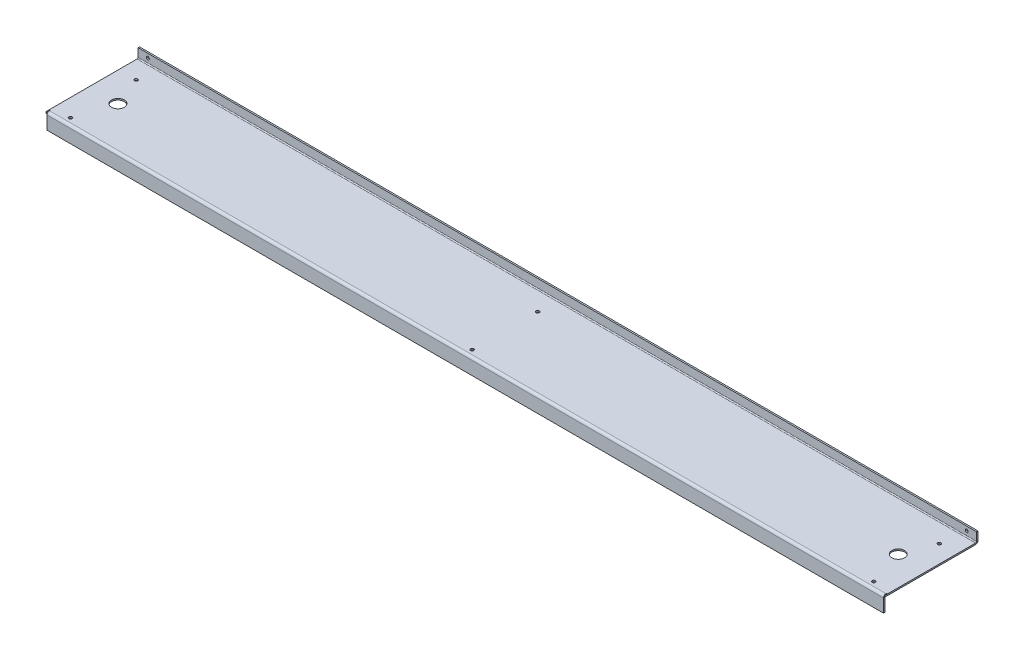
ISO-10303-21;
HEADER;
FILE_DESCRIPTION(('STEP AP214'),'2;1');
FILE_NAME('part.step','',(''),(''),'','','');
FILE_SCHEMA(('AUTOMOTIVE_DESIGN { 1 0 10303 214 1 1 1 1 }'));
ENDSEC;
DATA;
#1=APPLICATION_CONTEXT('core data for automotive mechanical design processes');
#2=APPLICATION_PROTOCOL_DEFINITION('international standard','automotive_design',2000,#1);
#3=PRODUCT_CONTEXT('',#1,'mechanical');
#4=PRODUCT('Part','Part','',(#3));
#5=PRODUCT_RELATED_PRODUCT_CATEGORY('part','',(#4));
#6=PRODUCT_DEFINITION_FORMATION('','',#4);
#7=PRODUCT_DEFINITION_CONTEXT('part definition',#1,'design');
#8=PRODUCT_DEFINITION('design','',#6,#7);
#9=PRODUCT_DEFINITION_SHAPE('','',#8);
#10=(LENGTH_UNIT() NAMED_UNIT(*) SI_UNIT(.MILLI.,.METRE.));
#11=(NAMED_UNIT(*) PLANE_ANGLE_UNIT() SI_UNIT($,.RADIAN.));
#12=(NAMED_UNIT(*) SI_UNIT($,.STERADIAN.) SOLID_ANGLE_UNIT());
#13=UNCERTAINTY_MEASURE_WITH_UNIT(LENGTH_MEASURE(1.E-05),#10,'distance_accuracy_value','');
#14=(GEOMETRIC_REPRESENTATION_CONTEXT(3) GLOBAL_UNCERTAINTY_ASSIGNED_CONTEXT((#13)) GLOBAL_UNIT_ASSIGNED_CONTEXT((#10,
#11,#12)) REPRESENTATION_CONTEXT('',''));
#15=CARTESIAN_POINT('',(0.,0.,0.));
#16=DIRECTION('',(0.,0.,1.));
#17=DIRECTION('',(1.,0.,0.));
#18=AXIS2_PLACEMENT_3D('',#15,#16,#17);
#19=CARTESIAN_POINT('',(0.,272.7,9.61011135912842E-13));
#20=DIRECTION('',(0.,1.,0.));
#21=DIRECTION('',(0.,0.,1.));
#22=AXIS2_PLACEMENT_3D('',#19,#20,#21);
#23=PLANE('',#22);
#24=CARTESIAN_POINT('',(398.399999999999,272.7,51.7500000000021));
#25=DIRECTION('',(0.,-1.,0.));
#26=DIRECTION('',(0.,0.,-1.));
#27=AXIS2_PLACEMENT_3D('',#24,#25,#26);
#28=CIRCLE('',#27,6.50000000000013);
#29=CARTESIAN_POINT('',(398.399999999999,272.7,45.250000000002));
#30=VERTEX_POINT('',#29);
#31=EDGE_CURVE('E480',#30,#30,#28,.T.);
#32=ORIENTED_EDGE('',*,*,#31,.F.);
#33=EDGE_LOOP('',(#32));
#34=FACE_BOUND('',#33,.T.);
#35=CARTESIAN_POINT('',(-398.4,272.7,51.7500000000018));
#36=DIRECTION('',(0.,-1.,0.));
#37=DIRECTION('',(0.,0.,-1.));
#38=AXIS2_PLACEMENT_3D('',#35,#36,#37);
#39=CIRCLE('',#38,6.50000000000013);
#40=CARTESIAN_POINT('',(-398.4,272.7,45.2500000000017));
#41=VERTEX_POINT('',#40);
#42=EDGE_CURVE('E474',#41,#41,#39,.T.);
#43=ORIENTED_EDGE('',*,*,#42,.F.);
#44=EDGE_LOOP('',(#43));
#45=FACE_BOUND('',#44,.T.);
#46=CARTESIAN_POINT('',(-410.099999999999,272.7,88.5000000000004));
#47=DIRECTION('',(0.,-1.,0.));
#48=DIRECTION('',(0.,0.,-1.));
#49=AXIS2_PLACEMENT_3D('',#46,#47,#48);
#50=CIRCLE('',#49,1.65000000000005);
#51=CARTESIAN_POINT('',(-410.099999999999,272.7,86.8500000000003));
#52=VERTEX_POINT('',#51);
#53=EDGE_CURVE('E456',#52,#52,#50,.T.);
#54=ORIENTED_EDGE('',*,*,#53,.F.);
#55=EDGE_LOOP('',(#54));
#56=FACE_BOUND('',#55,.T.);
#57=CARTESIAN_POINT('',(-1.65867280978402E-13,272.7,21.5000000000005));
#58=DIRECTION('',(0.,-1.,0.));
#59=DIRECTION('',(0.,0.,-1.));
#60=AXIS2_PLACEMENT_3D('',#57,#58,#59);
#61=CIRCLE('',#60,1.65);
#62=CARTESIAN_POINT('',(-1.65867280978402E-13,272.7,19.8500000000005));
#63=VERTEX_POINT('',#62);
#64=EDGE_CURVE('E463',#63,#63,#61,.T.);
#65=ORIENTED_EDGE('',*,*,#64,.F.);
#66=EDGE_LOOP('',(#65));
#67=FACE_BOUND('',#66,.T.);
#68=CARTESIAN_POINT('',(4.44755382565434E-13,272.7,88.5000000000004));
#69=DIRECTION('',(0.,-1.,0.));
#70=DIRECTION('',(0.,0.,-1.));
#71=AXIS2_PLACEMENT_3D('',#68,#69,#70);
#72=CIRCLE('',#71,1.65);
#73=CARTESIAN_POINT('',(4.44755382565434E-13,272.7,86.8500000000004));
#74=VERTEX_POINT('',#73);
#75=EDGE_CURVE('E444',#74,#74,#72,.T.);
#76=ORIENTED_EDGE('',*,*,#75,.F.);
#77=EDGE_LOOP('',(#76));
#78=FACE_BOUND('',#77,.T.);
#79=CARTESIAN_POINT('',(410.1,272.7,21.5000000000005));
#80=DIRECTION('',(0.,-1.,0.));
#81=DIRECTION('',(0.,0.,-1.));
#82=AXIS2_PLACEMENT_3D('',#79,#80,#81);
#83=CIRCLE('',#82,1.65000000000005);
#84=CARTESIAN_POINT('',(410.1,272.7,19.8500000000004));
#85=VERTEX_POINT('',#84);
#86=EDGE_CURVE('E451',#85,#85,#83,.T.);
#87=ORIENTED_EDGE('',*,*,#86,.F.);
#88=EDGE_LOOP('',(#87));
#89=FACE_BOUND('',#88,.T.);
#90=CARTESIAN_POINT('',(-410.1,272.7,21.5000000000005));
#91=DIRECTION('',(0.,-1.,0.));
#92=DIRECTION('',(0.,0.,-1.));
#93=AXIS2_PLACEMENT_3D('',#90,#91,#92);
#94=CIRCLE('',#93,1.65000000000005);
#95=CARTESIAN_POINT('',(-410.1,272.7,19.8500000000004));
#96=VERTEX_POINT('',#95);
#97=EDGE_CURVE('E468',#96,#96,#94,.T.);
#98=ORIENTED_EDGE('',*,*,#97,.F.);
#99=EDGE_LOOP('',(#98));
#100=FACE_BOUND('',#99,.T.);
#101=CARTESIAN_POINT('',(410.1,272.7,88.5000000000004));
#102=DIRECTION('',(0.,-1.,0.));
#103=DIRECTION('',(0.,0.,-1.));
#104=AXIS2_PLACEMENT_3D('',#101,#102,#103);
#105=CIRCLE('',#104,1.65000000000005);
#106=CARTESIAN_POINT('',(410.1,272.7,86.8500000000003));
#107=VERTEX_POINT('',#106);
#108=EDGE_CURVE('E438',#107,#107,#105,.T.);
#109=ORIENTED_EDGE('',*,*,#108,.F.);
#110=EDGE_LOOP('',(#109));
#111=FACE_BOUND('',#110,.T.);
#112=DIRECTION('',(0.,0.,-1.));
#113=VECTOR('',#112,1.);
#114=CARTESIAN_POINT('',(-427.85,272.7,95.5));
#115=LINE('',#114,#113);
#116=CARTESIAN_POINT('',(-427.85,272.7,95.5));
#117=VERTEX_POINT('',#116);
#118=CARTESIAN_POINT('',(-427.85,272.7,92.25));
#119=VERTEX_POINT('',#118);
#120=EDGE_CURVE('E284',#117,#119,#115,.T.);
#121=ORIENTED_EDGE('',*,*,#120,.F.);
#122=DIRECTION('',(-1.,0.,0.));
#123=VECTOR('',#122,1.);
#124=CARTESIAN_POINT('',(0.,272.7,95.5));
#125=LINE('',#124,#123);
#126=CARTESIAN_POINT('',(-428.1,272.7,95.5));
#127=VERTEX_POINT('',#126);
#128=EDGE_CURVE('E333',#117,#127,#125,.T.);
#129=ORIENTED_EDGE('',*,*,#128,.T.);
#130=DIRECTION('',(0.,0.,-1.));
#131=VECTOR('',#130,1.);
#132=CARTESIAN_POINT('',(-428.1,272.7,4.55387224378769E-13));
#133=LINE('',#132,#131);
#134=CARTESIAN_POINT('',(-428.1,272.7,2.5));
#135=VERTEX_POINT('',#134);
#136=EDGE_CURVE('E327',#127,#135,#133,.T.);
#137=ORIENTED_EDGE('',*,*,#136,.T.);
#138=DIRECTION('',(1.,0.,0.));
#139=VECTOR('',#138,1.);
#140=CARTESIAN_POINT('',(-428.1,272.7,2.5));
#141=LINE('',#140,#139);
#142=CARTESIAN_POINT('',(428.1,272.7,2.5));
#143=VERTEX_POINT('',#142);
#144=EDGE_CURVE('E344',#143,#135,#141,.F.);
#145=ORIENTED_EDGE('',*,*,#144,.F.);
#146=DIRECTION('',(0.,0.,1.));
#147=VECTOR('',#146,1.);
#148=CARTESIAN_POINT('',(428.1,272.7,9.61011135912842E-13));
#149=LINE('',#148,#147);
#150=CARTESIAN_POINT('',(428.1,272.7,95.5));
#151=VERTEX_POINT('',#150);
#152=EDGE_CURVE('E334',#143,#151,#149,.T.);
#153=ORIENTED_EDGE('',*,*,#152,.T.);
#154=CARTESIAN_POINT('',(427.85,272.7,95.5));
#155=VERTEX_POINT('',#154);
#156=EDGE_CURVE('E330',#151,#155,#125,.T.);
#157=ORIENTED_EDGE('',*,*,#156,.T.);
#158=DIRECTION('',(0.,0.,1.));
#159=VECTOR('',#158,1.);
#160=CARTESIAN_POINT('',(427.85,272.7,92.25));
#161=LINE('',#160,#159);
#162=CARTESIAN_POINT('',(427.85,272.7,92.25));
#163=VERTEX_POINT('',#162);
#164=EDGE_CURVE('E300',#163,#155,#161,.T.);
#165=ORIENTED_EDGE('',*,*,#164,.F.);
#166=DIRECTION('',(1.,0.,0.));
#167=VECTOR('',#166,1.);
#168=CARTESIAN_POINT('',(427.1,272.7,92.25));
#169=LINE('',#168,#167);
#170=CARTESIAN_POINT('',(427.1,272.7,92.25));
#171=VERTEX_POINT('',#170);
#172=EDGE_CURVE('E296',#171,#163,#169,.T.);
#173=ORIENTED_EDGE('',*,*,#172,.F.);
#174=DIRECTION('',(0.,0.,-1.));
#175=VECTOR('',#174,1.);
#176=CARTESIAN_POINT('',(427.1,272.7,93.));
#177=LINE('',#176,#175);
#178=CARTESIAN_POINT('',(427.1,272.7,93.));
#179=VERTEX_POINT('',#178);
#180=EDGE_CURVE('E293',#179,#171,#177,.T.);
#181=ORIENTED_EDGE('',*,*,#180,.F.);
#182=DIRECTION('',(-1.,0.,0.));
#183=VECTOR('',#182,1.);
#184=CARTESIAN_POINT('',(-427.1,272.7,93.));
#185=LINE('',#184,#183);
#186=CARTESIAN_POINT('',(-427.1,272.7,93.));
#187=VERTEX_POINT('',#186);
#188=EDGE_CURVE('E275',#187,#179,#185,.F.);
#189=ORIENTED_EDGE('',*,*,#188,.F.);
#190=DIRECTION('',(0.,0.,1.));
#191=VECTOR('',#190,1.);
#192=CARTESIAN_POINT('',(-427.1,272.7,92.25));
#193=LINE('',#192,#191);
#194=CARTESIAN_POINT('',(-427.1,272.7,92.25));
#195=VERTEX_POINT('',#194);
#196=EDGE_CURVE('E98',#195,#187,#193,.T.);
#197=ORIENTED_EDGE('',*,*,#196,.F.);
#198=DIRECTION('',(1.,0.,0.));
#199=VECTOR('',#198,1.);
#200=CARTESIAN_POINT('',(-427.85,272.7,92.25));
#201=LINE('',#200,#199);
#202=EDGE_CURVE('E93',#119,#195,#201,.T.);
#203=ORIENTED_EDGE('',*,*,#202,.F.);
#204=EDGE_LOOP('',(#121,#129,#137,#145,#153,#157,#165,#173,#181,#189,#197,#203));
#205=FACE_BOUND('',#204,.T.);
#206=ADVANCED_FACE('F78',(#34,#45,#56,#67,#78,#89,#100,#111,#205),#23,.F.);
#207=CARTESIAN_POINT('',(0.,274.2,9.66248357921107E-13));
#208=DIRECTION('',(0.,1.,0.));
#209=DIRECTION('',(0.,0.,1.));
#210=AXIS2_PLACEMENT_3D('',#207,#208,#209);
#211=PLANE('',#210);
#212=CARTESIAN_POINT('',(398.399999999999,274.2,51.7500000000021));
#213=DIRECTION('',(0.,-1.,0.));
#214=DIRECTION('',(0.,0.,-1.));
#215=AXIS2_PLACEMENT_3D('',#212,#213,#214);
#216=CIRCLE('',#215,6.50000000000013);
#217=CARTESIAN_POINT('',(398.399999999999,274.2,45.250000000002));
#218=VERTEX_POINT('',#217);
#219=EDGE_CURVE('E471',#218,#218,#216,.T.);
#220=ORIENTED_EDGE('',*,*,#219,.T.);
#221=EDGE_LOOP('',(#220));
#222=FACE_BOUND('',#221,.T.);
#223=CARTESIAN_POINT('',(-398.4,274.2,51.7500000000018));
#224=DIRECTION('',(0.,-1.,0.));
#225=DIRECTION('',(0.,0.,-1.));
#226=AXIS2_PLACEMENT_3D('',#223,#224,#225);
#227=CIRCLE('',#226,6.50000000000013);
#228=CARTESIAN_POINT('',(-398.4,274.2,45.2500000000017));
#229=VERTEX_POINT('',#228);
#230=EDGE_CURVE('E477',#229,#229,#227,.T.);
#231=ORIENTED_EDGE('',*,*,#230,.T.);
#232=EDGE_LOOP('',(#231));
#233=FACE_BOUND('',#232,.T.);
#234=CARTESIAN_POINT('',(-410.099999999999,274.2,88.5000000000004));
#235=DIRECTION('',(0.,-1.,0.));
#236=DIRECTION('',(0.,0.,-1.));
#237=AXIS2_PLACEMENT_3D('',#234,#235,#236);
#238=CIRCLE('',#237,1.65000000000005);
#239=CARTESIAN_POINT('',(-410.099999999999,274.2,86.8500000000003));
#240=VERTEX_POINT('',#239);
#241=EDGE_CURVE('E459',#240,#240,#238,.T.);
#242=ORIENTED_EDGE('',*,*,#241,.T.);
#243=EDGE_LOOP('',(#242));
#244=FACE_BOUND('',#243,.T.);
#245=CARTESIAN_POINT('',(-1.65867280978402E-13,274.2,21.5000000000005));
#246=DIRECTION('',(0.,-1.,0.));
#247=DIRECTION('',(0.,0.,-1.));
#248=AXIS2_PLACEMENT_3D('',#245,#246,#247);
#249=CIRCLE('',#248,1.65);
#250=CARTESIAN_POINT('',(-1.65867280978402E-13,274.2,19.8500000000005));
#251=VERTEX_POINT('',#250);
#252=EDGE_CURVE('E448',#251,#251,#249,.T.);
#253=ORIENTED_EDGE('',*,*,#252,.T.);
#254=EDGE_LOOP('',(#253));
#255=FACE_BOUND('',#254,.T.);
#256=CARTESIAN_POINT('',(4.44755382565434E-13,274.2,88.5000000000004));
#257=DIRECTION('',(0.,-1.,0.));
#258=DIRECTION('',(0.,0.,-1.));
#259=AXIS2_PLACEMENT_3D('',#256,#257,#258);
#260=CIRCLE('',#259,1.65);
#261=CARTESIAN_POINT('',(4.44755382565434E-13,274.2,86.8500000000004));
#262=VERTEX_POINT('',#261);
#263=EDGE_CURVE('E447',#262,#262,#260,.T.);
#264=ORIENTED_EDGE('',*,*,#263,.T.);
#265=EDGE_LOOP('',(#264));
#266=FACE_BOUND('',#265,.T.);
#267=CARTESIAN_POINT('',(410.1,274.2,21.5000000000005));
#268=DIRECTION('',(0.,-1.,0.));
#269=DIRECTION('',(0.,0.,-1.));
#270=AXIS2_PLACEMENT_3D('',#267,#268,#269);
#271=CIRCLE('',#270,1.65000000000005);
#272=CARTESIAN_POINT('',(410.1,274.2,19.8500000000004));
#273=VERTEX_POINT('',#272);
#274=EDGE_CURVE('E441',#273,#273,#271,.T.);
#275=ORIENTED_EDGE('',*,*,#274,.T.);
#276=EDGE_LOOP('',(#275));
#277=FACE_BOUND('',#276,.T.);
#278=CARTESIAN_POINT('',(-410.1,274.2,21.5000000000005));
#279=DIRECTION('',(0.,-1.,0.));
#280=DIRECTION('',(0.,0.,-1.));
#281=AXIS2_PLACEMENT_3D('',#278,#279,#280);
#282=CIRCLE('',#281,1.65000000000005);
#283=CARTESIAN_POINT('',(-410.1,274.2,19.8500000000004));
#284=VERTEX_POINT('',#283);
#285=EDGE_CURVE('E460',#284,#284,#282,.T.);
#286=ORIENTED_EDGE('',*,*,#285,.T.);
#287=EDGE_LOOP('',(#286));
#288=FACE_BOUND('',#287,.T.);
#289=CARTESIAN_POINT('',(410.1,274.2,88.5000000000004));
#290=DIRECTION('',(0.,-1.,0.));
#291=DIRECTION('',(0.,0.,-1.));
#292=AXIS2_PLACEMENT_3D('',#289,#290,#291);
#293=CIRCLE('',#292,1.65000000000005);
#294=CARTESIAN_POINT('',(410.1,274.2,86.8500000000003));
#295=VERTEX_POINT('',#294);
#296=EDGE_CURVE('E430',#295,#295,#293,.T.);
#297=ORIENTED_EDGE('',*,*,#296,.T.);
#298=EDGE_LOOP('',(#297));
#299=FACE_BOUND('',#298,.T.);
#300=DIRECTION('',(1.,0.,0.));
#301=VECTOR('',#300,1.);
#302=CARTESIAN_POINT('',(-428.1,274.2,95.5));
#303=LINE('',#302,#301);
#304=CARTESIAN_POINT('',(-427.85,274.2,95.5));
#305=VERTEX_POINT('',#304);
#306=CARTESIAN_POINT('',(-428.1,274.2,95.5));
#307=VERTEX_POINT('',#306);
#308=EDGE_CURVE('E341',#305,#307,#303,.F.);
#309=ORIENTED_EDGE('',*,*,#308,.F.);
#310=DIRECTION('',(0.,0.,-1.));
#311=VECTOR('',#310,1.);
#312=CARTESIAN_POINT('',(-427.85,274.2,9.66248357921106E-13));
#313=LINE('',#312,#311);
#314=CARTESIAN_POINT('',(-427.85,274.2,92.25));
#315=VERTEX_POINT('',#314);
#316=EDGE_CURVE('E317',#305,#315,#313,.T.);
#317=ORIENTED_EDGE('',*,*,#316,.T.);
#318=DIRECTION('',(1.,0.,0.));
#319=VECTOR('',#318,1.);
#320=CARTESIAN_POINT('',(0.,274.2,92.25));
#321=LINE('',#320,#319);
#322=CARTESIAN_POINT('',(-427.1,274.2,92.25));
#323=VERTEX_POINT('',#322);
#324=EDGE_CURVE('E13',#315,#323,#321,.T.);
#325=ORIENTED_EDGE('',*,*,#324,.T.);
#326=DIRECTION('',(0.,0.,1.));
#327=VECTOR('',#326,1.);
#328=CARTESIAN_POINT('',(-427.1,274.2,9.66248357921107E-13));
#329=LINE('',#328,#327);
#330=CARTESIAN_POINT('',(-427.1,274.2,93.));
#331=VERTEX_POINT('',#330);
#332=EDGE_CURVE('E86',#323,#331,#329,.T.);
#333=ORIENTED_EDGE('',*,*,#332,.T.);
#334=DIRECTION('',(-1.,0.,0.));
#335=VECTOR('',#334,1.);
#336=CARTESIAN_POINT('',(-427.1,274.2,93.));
#337=LINE('',#336,#335);
#338=CARTESIAN_POINT('',(427.1,274.2,93.));
#339=VERTEX_POINT('',#338);
#340=EDGE_CURVE('E220',#331,#339,#337,.F.);
#341=ORIENTED_EDGE('',*,*,#340,.T.);
#342=DIRECTION('',(0.,0.,-1.));
#343=VECTOR('',#342,1.);
#344=CARTESIAN_POINT('',(427.1,274.2,9.66248357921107E-13));
#345=LINE('',#344,#343);
#346=CARTESIAN_POINT('',(427.1,274.2,92.25));
#347=VERTEX_POINT('',#346);
#348=EDGE_CURVE('E396',#339,#347,#345,.T.);
#349=ORIENTED_EDGE('',*,*,#348,.T.);
#350=DIRECTION('',(1.,0.,0.));
#351=VECTOR('',#350,1.);
#352=CARTESIAN_POINT('',(0.,274.2,92.25));
#353=LINE('',#352,#351);
#354=CARTESIAN_POINT('',(427.85,274.2,92.25));
#355=VERTEX_POINT('',#354);
#356=EDGE_CURVE('E394',#347,#355,#353,.T.);
#357=ORIENTED_EDGE('',*,*,#356,.T.);
#358=DIRECTION('',(0.,0.,1.));
#359=VECTOR('',#358,1.);
#360=CARTESIAN_POINT('',(427.85,274.2,9.66248357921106E-13));
#361=LINE('',#360,#359);
#362=CARTESIAN_POINT('',(427.85,274.2,95.5));
#363=VERTEX_POINT('',#362);
#364=EDGE_CURVE('E287',#355,#363,#361,.T.);
#365=ORIENTED_EDGE('',*,*,#364,.T.);
#366=CARTESIAN_POINT('',(428.1,274.2,95.5));
#367=VERTEX_POINT('',#366);
#368=EDGE_CURVE('E339',#367,#363,#303,.F.);
#369=ORIENTED_EDGE('',*,*,#368,.F.);
#370=DIRECTION('',(0.,0.,-1.));
#371=VECTOR('',#370,1.);
#372=CARTESIAN_POINT('',(428.1,274.2,95.5));
#373=LINE('',#372,#371);
#374=CARTESIAN_POINT('',(428.1,274.2,2.5));
#375=VERTEX_POINT('',#374);
#376=EDGE_CURVE('E342',#375,#367,#373,.F.);
#377=ORIENTED_EDGE('',*,*,#376,.F.);
#378=DIRECTION('',(1.,0.,0.));
#379=VECTOR('',#378,1.);
#380=CARTESIAN_POINT('',(-428.1,274.2,2.5));
#381=LINE('',#380,#379);
#382=CARTESIAN_POINT('',(-428.1,274.2,2.5));
#383=VERTEX_POINT('',#382);
#384=EDGE_CURVE('E349',#383,#375,#381,.T.);
#385=ORIENTED_EDGE('',*,*,#384,.F.);
#386=DIRECTION('',(0.,0.,1.));
#387=VECTOR('',#386,1.);
#388=CARTESIAN_POINT('',(-428.1,274.2,1.5));
#389=LINE('',#388,#387);
#390=EDGE_CURVE('E336',#307,#383,#389,.F.);
#391=ORIENTED_EDGE('',*,*,#390,.F.);
#392=EDGE_LOOP('',(#309,#317,#325,#333,#341,#349,#357,#365,#369,#377,#385,#391));
#393=FACE_BOUND('',#392,.T.);
#394=ADVANCED_FACE('F400',(#222,#233,#244,#255,#266,#277,#288,#299,#393),#211,.T.);
#395=CARTESIAN_POINT('',(-428.1,272.7,95.5));
#396=DIRECTION('',(0.,0.,-1.));
#397=DIRECTION('',(0.,1.,0.));
#398=AXIS2_PLACEMENT_3D('',#395,#396,#397);
#399=PLANE('',#398);
#400=DIRECTION('',(0.,1.,0.));
#401=VECTOR('',#400,1.);
#402=CARTESIAN_POINT('',(-427.85,272.7,95.5));
#403=LINE('',#402,#401);
#404=EDGE_CURVE('E288',#117,#305,#403,.T.);
#405=ORIENTED_EDGE('',*,*,#404,.T.);
#406=ORIENTED_EDGE('',*,*,#308,.T.);
#407=DIRECTION('',(0.,1.,0.));
#408=VECTOR('',#407,1.);
#409=CARTESIAN_POINT('',(-428.1,272.7,95.5));
#410=LINE('',#409,#408);
#411=EDGE_CURVE('E324',#127,#307,#410,.T.);
#412=ORIENTED_EDGE('',*,*,#411,.F.);
#413=ORIENTED_EDGE('',*,*,#128,.F.);
#414=EDGE_LOOP('',(#405,#406,#412,#413));
#415=FACE_BOUND('',#414,.T.);
#416=ADVANCED_FACE('F577',(#415),#399,.F.);
#417=DIRECTION('',(0.,1.,0.));
#418=VECTOR('',#417,1.);
#419=CARTESIAN_POINT('',(427.85,272.7,95.5));
#420=LINE('',#419,#418);
#421=EDGE_CURVE('E303',#155,#363,#420,.T.);
#422=ORIENTED_EDGE('',*,*,#421,.F.);
#423=ORIENTED_EDGE('',*,*,#156,.F.);
#424=DIRECTION('',(0.,1.,0.));
#425=VECTOR('',#424,1.);
#426=CARTESIAN_POINT('',(428.1,272.7,95.5));
#427=LINE('',#426,#425);
#428=EDGE_CURVE('E320',#151,#367,#427,.T.);
#429=ORIENTED_EDGE('',*,*,#428,.T.);
#430=ORIENTED_EDGE('',*,*,#368,.T.);
#431=EDGE_LOOP('',(#422,#423,#429,#430));
#432=FACE_BOUND('',#431,.T.);
#433=ADVANCED_FACE('F584',(#432),#399,.F.);
#434=CARTESIAN_POINT('',(-428.1,283.7,1.5));
#435=DIRECTION('',(1.,0.,0.));
#436=DIRECTION('',(0.,0.,-1.));
#437=AXIS2_PLACEMENT_3D('',#434,#435,#436);
#438=PLANE('',#437);
#439=DIRECTION('',(0.,0.,-1.));
#440=VECTOR('',#439,1.);
#441=CARTESIAN_POINT('',(-428.1,275.2,1.50000000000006));
#442=LINE('',#441,#440);
#443=CARTESIAN_POINT('',(-428.1,275.2,1.5));
#444=VERTEX_POINT('',#443);
#445=CARTESIAN_POINT('',(-428.1,275.2,0.));
#446=VERTEX_POINT('',#445);
#447=EDGE_CURVE('E370',#444,#446,#442,.T.);
#448=ORIENTED_EDGE('',*,*,#447,.F.);
#449=DIRECTION('',(0.,-1.,0.));
#450=VECTOR('',#449,1.);
#451=CARTESIAN_POINT('',(-428.1,283.7,1.5));
#452=LINE('',#451,#450);
#453=CARTESIAN_POINT('',(-428.1,283.7,1.5));
#454=VERTEX_POINT('',#453);
#455=EDGE_CURVE('E375',#454,#444,#452,.T.);
#456=ORIENTED_EDGE('',*,*,#455,.F.);
#457=DIRECTION('',(0.,0.,-1.));
#458=VECTOR('',#457,1.);
#459=CARTESIAN_POINT('',(-428.1,283.7,1.5));
#460=LINE('',#459,#458);
#461=CARTESIAN_POINT('',(-428.1,283.7,0.));
#462=VERTEX_POINT('',#461);
#463=EDGE_CURVE('E383',#454,#462,#460,.T.);
#464=ORIENTED_EDGE('',*,*,#463,.T.);
#465=DIRECTION('',(0.,-1.,0.));
#466=VECTOR('',#465,1.);
#467=CARTESIAN_POINT('',(-428.1,283.7,0.));
#468=LINE('',#467,#466);
#469=EDGE_CURVE('E373',#462,#446,#468,.T.);
#470=ORIENTED_EDGE('',*,*,#469,.T.);
#471=EDGE_LOOP('',(#448,#456,#464,#470));
#472=FACE_BOUND('',#471,.T.);
#473=ADVANCED_FACE('F80',(#472),#438,.F.);
#474=CARTESIAN_POINT('',(428.1,283.7,1.5));
#475=DIRECTION('',(-1.,0.,0.));
#476=DIRECTION('',(0.,0.,1.));
#477=AXIS2_PLACEMENT_3D('',#474,#475,#476);
#478=PLANE('',#477);
#479=DIRECTION('',(0.,0.,-1.));
#480=VECTOR('',#479,1.);
#481=CARTESIAN_POINT('',(428.1,275.2,1.50000000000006));
#482=LINE('',#481,#480);
#483=CARTESIAN_POINT('',(428.1,275.2,1.5));
#484=VERTEX_POINT('',#483);
#485=CARTESIAN_POINT('',(428.1,275.2,0.));
#486=VERTEX_POINT('',#485);
#487=EDGE_CURVE('E359',#484,#486,#482,.T.);
#488=ORIENTED_EDGE('',*,*,#487,.T.);
#489=DIRECTION('',(0.,1.,0.));
#490=VECTOR('',#489,1.);
#491=CARTESIAN_POINT('',(428.1,283.7,0.));
#492=LINE('',#491,#490);
#493=CARTESIAN_POINT('',(428.1,283.7,0.));
#494=VERTEX_POINT('',#493);
#495=EDGE_CURVE('E386',#486,#494,#492,.T.);
#496=ORIENTED_EDGE('',*,*,#495,.T.);
#497=DIRECTION('',(0.,0.,-1.));
#498=VECTOR('',#497,1.);
#499=CARTESIAN_POINT('',(428.1,283.7,1.5));
#500=LINE('',#499,#498);
#501=CARTESIAN_POINT('',(428.1,283.7,1.5));
#502=VERTEX_POINT('',#501);
#503=EDGE_CURVE('E391',#502,#494,#500,.T.);
#504=ORIENTED_EDGE('',*,*,#503,.F.);
#505=DIRECTION('',(0.,1.,0.));
#506=VECTOR('',#505,1.);
#507=CARTESIAN_POINT('',(428.1,283.7,1.5));
#508=LINE('',#507,#506);
#509=EDGE_CURVE('E378',#484,#502,#508,.T.);
#510=ORIENTED_EDGE('',*,*,#509,.F.);
#511=EDGE_LOOP('',(#488,#496,#504,#510));
#512=FACE_BOUND('',#511,.T.);
#513=ADVANCED_FACE('F610',(#512),#478,.F.);
#514=CARTESIAN_POINT('',(0.,0.,1.5));
#515=DIRECTION('',(0.,0.,1.));
#516=DIRECTION('',(1.,0.,0.));
#517=AXIS2_PLACEMENT_3D('',#514,#515,#516);
#518=PLANE('',#517);
#519=CARTESIAN_POINT('',(-418.1,279.45,1.5));
#520=DIRECTION('',(0.,0.,1.));
#521=DIRECTION('',(1.,0.,0.));
#522=AXIS2_PLACEMENT_3D('',#519,#520,#521);
#523=CIRCLE('',#522,1.50000000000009);
#524=CARTESIAN_POINT('',(-416.6,279.45,1.5));
#525=VERTEX_POINT('',#524);
#526=EDGE_CURVE('E433',#525,#525,#523,.T.);
#527=ORIENTED_EDGE('',*,*,#526,.F.);
#528=EDGE_LOOP('',(#527));
#529=FACE_BOUND('',#528,.T.);
#530=CARTESIAN_POINT('',(418.1,279.45,1.5));
#531=DIRECTION('',(0.,0.,1.));
#532=DIRECTION('',(1.,0.,0.));
#533=AXIS2_PLACEMENT_3D('',#530,#531,#532);
#534=CIRCLE('',#533,1.50000000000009);
#535=CARTESIAN_POINT('',(419.6,279.45,1.5));
#536=VERTEX_POINT('',#535);
#537=EDGE_CURVE('E426',#536,#536,#534,.T.);
#538=ORIENTED_EDGE('',*,*,#537,.F.);
#539=EDGE_LOOP('',(#538));
#540=FACE_BOUND('',#539,.T.);
#541=ORIENTED_EDGE('',*,*,#455,.T.);
#542=DIRECTION('',(1.,0.,0.));
#543=VECTOR('',#542,1.);
#544=CARTESIAN_POINT('',(428.1,275.2,1.50000000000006));
#545=LINE('',#544,#543);
#546=EDGE_CURVE('E365',#484,#444,#545,.F.);
#547=ORIENTED_EDGE('',*,*,#546,.F.);
#548=ORIENTED_EDGE('',*,*,#509,.T.);
#549=DIRECTION('',(-1.,0.,0.));
#550=VECTOR('',#549,1.);
#551=CARTESIAN_POINT('',(-428.1,283.7,1.5));
#552=LINE('',#551,#550);
#553=EDGE_CURVE('E381',#502,#454,#552,.T.);
#554=ORIENTED_EDGE('',*,*,#553,.T.);
#555=EDGE_LOOP('',(#541,#547,#548,#554));
#556=FACE_BOUND('',#555,.T.);
#557=ADVANCED_FACE('F606',(#529,#540,#556),#518,.T.);
#558=CARTESIAN_POINT('',(0.,0.,0.));
#559=DIRECTION('',(0.,0.,1.));
#560=DIRECTION('',(1.,0.,0.));
#561=AXIS2_PLACEMENT_3D('',#558,#559,#560);
#562=PLANE('',#561);
#563=CARTESIAN_POINT('',(-418.1,279.45,0.));
#564=DIRECTION('',(0.,0.,1.));
#565=DIRECTION('',(1.,0.,0.));
#566=AXIS2_PLACEMENT_3D('',#563,#564,#565);
#567=CIRCLE('',#566,1.50000000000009);
#568=CARTESIAN_POINT('',(-416.6,279.45,0.));
#569=VERTEX_POINT('',#568);
#570=EDGE_CURVE('E268',#569,#569,#567,.T.);
#571=ORIENTED_EDGE('',*,*,#570,.T.);
#572=EDGE_LOOP('',(#571));
#573=FACE_BOUND('',#572,.T.);
#574=CARTESIAN_POINT('',(418.1,279.45,0.));
#575=DIRECTION('',(0.,0.,1.));
#576=DIRECTION('',(1.,0.,0.));
#577=AXIS2_PLACEMENT_3D('',#574,#575,#576);
#578=CIRCLE('',#577,1.50000000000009);
#579=CARTESIAN_POINT('',(419.6,279.45,0.));
#580=VERTEX_POINT('',#579);
#581=EDGE_CURVE('E429',#580,#580,#578,.T.);
#582=ORIENTED_EDGE('',*,*,#581,.T.);
#583=EDGE_LOOP('',(#582));
#584=FACE_BOUND('',#583,.T.);
#585=DIRECTION('',(1.,0.,0.));
#586=VECTOR('',#585,1.);
#587=CARTESIAN_POINT('',(428.1,275.2,0.));
#588=LINE('',#587,#586);
#589=EDGE_CURVE('E353',#486,#446,#588,.F.);
#590=ORIENTED_EDGE('',*,*,#589,.T.);
#591=ORIENTED_EDGE('',*,*,#469,.F.);
#592=DIRECTION('',(-1.,0.,0.));
#593=VECTOR('',#592,1.);
#594=CARTESIAN_POINT('',(-428.1,283.7,0.));
#595=LINE('',#594,#593);
#596=EDGE_CURVE('E379',#494,#462,#595,.T.);
#597=ORIENTED_EDGE('',*,*,#596,.F.);
#598=ORIENTED_EDGE('',*,*,#495,.F.);
#599=EDGE_LOOP('',(#590,#591,#597,#598));
#600=FACE_BOUND('',#599,.T.);
#601=ADVANCED_FACE('F609',(#573,#584,#600),#562,.F.);
#602=CARTESIAN_POINT('',(-428.1,283.7,1.5));
#603=DIRECTION('',(0.,-1.,0.));
#604=DIRECTION('',(1.,0.,0.));
#605=AXIS2_PLACEMENT_3D('',#602,#603,#604);
#606=PLANE('',#605);
#607=ORIENTED_EDGE('',*,*,#596,.T.);
#608=ORIENTED_EDGE('',*,*,#463,.F.);
#609=ORIENTED_EDGE('',*,*,#553,.F.);
#610=ORIENTED_EDGE('',*,*,#503,.T.);
#611=EDGE_LOOP('',(#607,#608,#609,#610));
#612=FACE_BOUND('',#611,.T.);
#613=ADVANCED_FACE('F601',(#612),#606,.F.);
#614=CARTESIAN_POINT('',(-428.1,275.2,2.50000000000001));
#615=DIRECTION('',(-1.,0.,0.));
#616=DIRECTION('',(0.,0.,1.));
#617=AXIS2_PLACEMENT_3D('',#614,#615,#616);
#618=PLANE('',#617);
#619=DIRECTION('',(0.,1.,0.));
#620=VECTOR('',#619,1.);
#621=CARTESIAN_POINT('',(-428.1,272.7,2.5));
#622=LINE('',#621,#620);
#623=EDGE_CURVE('E319',#383,#135,#622,.F.);
#624=ORIENTED_EDGE('',*,*,#623,.F.);
#625=CARTESIAN_POINT('',(-428.1,275.2,2.50000000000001));
#626=DIRECTION('',(1.,0.,0.));
#627=DIRECTION('',(0.,0.,-1.));
#628=AXIS2_PLACEMENT_3D('',#625,#626,#627);
#629=CIRCLE('',#628,0.999999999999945);
#630=EDGE_CURVE('E362',#444,#383,#629,.F.);
#631=ORIENTED_EDGE('',*,*,#630,.F.);
#632=ORIENTED_EDGE('',*,*,#447,.T.);
#633=CARTESIAN_POINT('',(-428.1,275.2,2.50000000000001));
#634=DIRECTION('',(1.,0.,0.));
#635=DIRECTION('',(0.,0.,-1.));
#636=AXIS2_PLACEMENT_3D('',#633,#634,#635);
#637=CIRCLE('',#636,2.49999999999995);
#638=EDGE_CURVE('E355',#446,#135,#637,.F.);
#639=ORIENTED_EDGE('',*,*,#638,.T.);
#640=EDGE_LOOP('',(#624,#631,#632,#639));
#641=FACE_BOUND('',#640,.T.);
#642=ADVANCED_FACE('F598',(#641),#618,.T.);
#643=CARTESIAN_POINT('',(428.1,275.2,2.50000000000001));
#644=DIRECTION('',(-1.,0.,0.));
#645=DIRECTION('',(0.,0.,1.));
#646=AXIS2_PLACEMENT_3D('',#643,#644,#645);
#647=PLANE('',#646);
#648=CARTESIAN_POINT('',(428.1,275.2,2.50000000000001));
#649=DIRECTION('',(1.,0.,0.));
#650=DIRECTION('',(0.,0.,-1.));
#651=AXIS2_PLACEMENT_3D('',#648,#649,#650);
#652=CIRCLE('',#651,0.999999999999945);
#653=EDGE_CURVE('E323',#375,#484,#652,.T.);
#654=ORIENTED_EDGE('',*,*,#653,.F.);
#655=DIRECTION('',(0.,1.,0.));
#656=VECTOR('',#655,1.);
#657=CARTESIAN_POINT('',(428.1,274.2,2.5));
#658=LINE('',#657,#656);
#659=EDGE_CURVE('E346',#375,#143,#658,.F.);
#660=ORIENTED_EDGE('',*,*,#659,.T.);
#661=CARTESIAN_POINT('',(428.1,275.2,2.50000000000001));
#662=DIRECTION('',(1.,0.,0.));
#663=DIRECTION('',(0.,0.,-1.));
#664=AXIS2_PLACEMENT_3D('',#661,#662,#663);
#665=CIRCLE('',#664,2.49999999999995);
#666=EDGE_CURVE('E356',#143,#486,#665,.T.);
#667=ORIENTED_EDGE('',*,*,#666,.T.);
#668=ORIENTED_EDGE('',*,*,#487,.F.);
#669=EDGE_LOOP('',(#654,#660,#667,#668));
#670=FACE_BOUND('',#669,.T.);
#671=ADVANCED_FACE('F593',(#670),#647,.F.);
#672=CARTESIAN_POINT('',(428.1,275.2,2.50000000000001));
#673=DIRECTION('',(1.,0.,0.));
#674=DIRECTION('',(0.,-1.,0.));
#675=AXIS2_PLACEMENT_3D('',#672,#673,#674);
#676=CYLINDRICAL_SURFACE('',#675,2.49999999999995);
#677=ORIENTED_EDGE('',*,*,#589,.F.);
#678=ORIENTED_EDGE('',*,*,#666,.F.);
#679=ORIENTED_EDGE('',*,*,#144,.T.);
#680=ORIENTED_EDGE('',*,*,#638,.F.);
#681=EDGE_LOOP('',(#677,#678,#679,#680));
#682=FACE_BOUND('',#681,.T.);
#683=ADVANCED_FACE('F590',(#682),#676,.T.);
#684=CARTESIAN_POINT('',(428.1,275.2,2.50000000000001));
#685=DIRECTION('',(1.,0.,0.));
#686=DIRECTION('',(0.,-1.,0.));
#687=AXIS2_PLACEMENT_3D('',#684,#685,#686);
#688=CYLINDRICAL_SURFACE('',#687,0.999999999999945);
#689=ORIENTED_EDGE('',*,*,#546,.T.);
#690=ORIENTED_EDGE('',*,*,#630,.T.);
#691=ORIENTED_EDGE('',*,*,#384,.T.);
#692=ORIENTED_EDGE('',*,*,#653,.T.);
#693=EDGE_LOOP('',(#689,#690,#691,#692));
#694=FACE_BOUND('',#693,.T.);
#695=ADVANCED_FACE('F588',(#694),#688,.F.);
#696=CARTESIAN_POINT('',(428.1,272.7,95.5));
#697=DIRECTION('',(-1.,0.,0.));
#698=DIRECTION('',(0.,-1.,0.));
#699=AXIS2_PLACEMENT_3D('',#696,#697,#698);
#700=PLANE('',#699);
#701=ORIENTED_EDGE('',*,*,#659,.F.);
#702=ORIENTED_EDGE('',*,*,#376,.T.);
#703=ORIENTED_EDGE('',*,*,#428,.F.);
#704=ORIENTED_EDGE('',*,*,#152,.F.);
#705=EDGE_LOOP('',(#701,#702,#703,#704));
#706=FACE_BOUND('',#705,.T.);
#707=ADVANCED_FACE('F580',(#706),#700,.F.);
#708=CARTESIAN_POINT('',(-428.1,272.7,1.49999999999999));
#709=DIRECTION('',(1.,0.,0.));
#710=DIRECTION('',(0.,0.,-1.));
#711=AXIS2_PLACEMENT_3D('',#708,#709,#710);
#712=PLANE('',#711);
#713=ORIENTED_EDGE('',*,*,#623,.T.);
#714=ORIENTED_EDGE('',*,*,#136,.F.);
#715=ORIENTED_EDGE('',*,*,#411,.T.);
#716=ORIENTED_EDGE('',*,*,#390,.T.);
#717=EDGE_LOOP('',(#713,#714,#715,#716));
#718=FACE_BOUND('',#717,.T.);
#719=ADVANCED_FACE('F572',(#718),#712,.F.);
#720=CARTESIAN_POINT('',(-427.85,272.7,95.5));
#721=DIRECTION('',(1.,0.,0.));
#722=DIRECTION('',(0.,1.,0.));
#723=AXIS2_PLACEMENT_3D('',#720,#721,#722);
#724=PLANE('',#723);
#725=ORIENTED_EDGE('',*,*,#316,.F.);
#726=ORIENTED_EDGE('',*,*,#404,.F.);
#727=ORIENTED_EDGE('',*,*,#120,.T.);
#728=DIRECTION('',(0.,1.,0.));
#729=VECTOR('',#728,1.);
#730=CARTESIAN_POINT('',(-427.85,272.7,92.25));
#731=LINE('',#730,#729);
#732=EDGE_CURVE('E290',#119,#315,#731,.T.);
#733=ORIENTED_EDGE('',*,*,#732,.T.);
#734=EDGE_LOOP('',(#725,#726,#727,#733));
#735=FACE_BOUND('',#734,.T.);
#736=ADVANCED_FACE('F569',(#735),#724,.T.);
#737=CARTESIAN_POINT('',(-427.85,272.7,92.25));
#738=DIRECTION('',(0.,0.,1.));
#739=DIRECTION('',(0.,-1.,0.));
#740=AXIS2_PLACEMENT_3D('',#737,#738,#739);
#741=PLANE('',#740);
#742=ORIENTED_EDGE('',*,*,#324,.F.);
#743=ORIENTED_EDGE('',*,*,#732,.F.);
#744=ORIENTED_EDGE('',*,*,#202,.T.);
#745=DIRECTION('',(0.,1.,0.));
#746=VECTOR('',#745,1.);
#747=CARTESIAN_POINT('',(-427.1,272.7,92.25));
#748=LINE('',#747,#746);
#749=EDGE_CURVE('E292',#195,#323,#748,.T.);
#750=ORIENTED_EDGE('',*,*,#749,.T.);
#751=EDGE_LOOP('',(#742,#743,#744,#750));
#752=FACE_BOUND('',#751,.T.);
#753=ADVANCED_FACE('F566',(#752),#741,.T.);
#754=CARTESIAN_POINT('',(-427.1,272.7,92.25));
#755=DIRECTION('',(-1.,0.,0.));
#756=DIRECTION('',(0.,-1.,0.));
#757=AXIS2_PLACEMENT_3D('',#754,#755,#756);
#758=PLANE('',#757);
#759=ORIENTED_EDGE('',*,*,#332,.F.);
#760=ORIENTED_EDGE('',*,*,#749,.F.);
#761=ORIENTED_EDGE('',*,*,#196,.T.);
#762=DIRECTION('',(0.,1.,0.));
#763=VECTOR('',#762,1.);
#764=CARTESIAN_POINT('',(-427.1,272.7,93.));
#765=LINE('',#764,#763);
#766=EDGE_CURVE('E271',#187,#331,#765,.T.);
#767=ORIENTED_EDGE('',*,*,#766,.T.);
#768=EDGE_LOOP('',(#759,#760,#761,#767));
#769=FACE_BOUND('',#768,.T.);
#770=ADVANCED_FACE('F404',(#769),#758,.T.);
#771=CARTESIAN_POINT('',(427.1,272.7,93.));
#772=DIRECTION('',(1.,0.,0.));
#773=DIRECTION('',(0.,1.,0.));
#774=AXIS2_PLACEMENT_3D('',#771,#772,#773);
#775=PLANE('',#774);
#776=ORIENTED_EDGE('',*,*,#348,.F.);
#777=DIRECTION('',(0.,1.,0.));
#778=VECTOR('',#777,1.);
#779=CARTESIAN_POINT('',(427.1,272.7,93.));
#780=LINE('',#779,#778);
#781=EDGE_CURVE('E278',#179,#339,#780,.T.);
#782=ORIENTED_EDGE('',*,*,#781,.F.);
#783=ORIENTED_EDGE('',*,*,#180,.T.);
#784=DIRECTION('',(0.,1.,0.));
#785=VECTOR('',#784,1.);
#786=CARTESIAN_POINT('',(427.1,272.7,92.25));
#787=LINE('',#786,#785);
#788=EDGE_CURVE('E299',#171,#347,#787,.T.);
#789=ORIENTED_EDGE('',*,*,#788,.T.);
#790=EDGE_LOOP('',(#776,#782,#783,#789));
#791=FACE_BOUND('',#790,.T.);
#792=ADVANCED_FACE('F413',(#791),#775,.T.);
#793=CARTESIAN_POINT('',(427.1,272.7,92.25));
#794=DIRECTION('',(0.,0.,1.));
#795=DIRECTION('',(0.,-1.,0.));
#796=AXIS2_PLACEMENT_3D('',#793,#794,#795);
#797=PLANE('',#796);
#798=ORIENTED_EDGE('',*,*,#356,.F.);
#799=ORIENTED_EDGE('',*,*,#788,.F.);
#800=ORIENTED_EDGE('',*,*,#172,.T.);
#801=DIRECTION('',(0.,1.,0.));
#802=VECTOR('',#801,1.);
#803=CARTESIAN_POINT('',(427.85,272.7,92.25));
#804=LINE('',#803,#802);
#805=EDGE_CURVE('E281',#163,#355,#804,.T.);
#806=ORIENTED_EDGE('',*,*,#805,.T.);
#807=EDGE_LOOP('',(#798,#799,#800,#806));
#808=FACE_BOUND('',#807,.T.);
#809=ADVANCED_FACE('F557',(#808),#797,.T.);
#810=CARTESIAN_POINT('',(427.85,272.7,92.25));
#811=DIRECTION('',(-1.,0.,0.));
#812=DIRECTION('',(0.,-1.,0.));
#813=AXIS2_PLACEMENT_3D('',#810,#811,#812);
#814=PLANE('',#813);
#815=ORIENTED_EDGE('',*,*,#364,.F.);
#816=ORIENTED_EDGE('',*,*,#805,.F.);
#817=ORIENTED_EDGE('',*,*,#164,.T.);
#818=ORIENTED_EDGE('',*,*,#421,.T.);
#819=EDGE_LOOP('',(#815,#816,#817,#818));
#820=FACE_BOUND('',#819,.T.);
#821=ADVANCED_FACE('F552',(#820),#814,.T.);
#822=CARTESIAN_POINT('',(427.1,271.7,93.));
#823=DIRECTION('',(1.,0.,0.));
#824=DIRECTION('',(0.,0.,-1.));
#825=AXIS2_PLACEMENT_3D('',#822,#823,#824);
#826=PLANE('',#825);
#827=DIRECTION('',(0.,0.,1.));
#828=VECTOR('',#827,1.);
#829=CARTESIAN_POINT('',(427.1,271.7,95.5));
#830=LINE('',#829,#828);
#831=CARTESIAN_POINT('',(427.1,271.7,94.));
#832=VERTEX_POINT('',#831);
#833=CARTESIAN_POINT('',(427.1,271.7,95.5));
#834=VERTEX_POINT('',#833);
#835=EDGE_CURVE('E265',#832,#834,#830,.T.);
#836=ORIENTED_EDGE('',*,*,#835,.F.);
#837=CARTESIAN_POINT('',(427.1,271.7,93.));
#838=DIRECTION('',(-1.,0.,0.));
#839=DIRECTION('',(0.,0.,1.));
#840=AXIS2_PLACEMENT_3D('',#837,#838,#839);
#841=CIRCLE('',#840,1.);
#842=EDGE_CURVE('E223',#179,#832,#841,.F.);
#843=ORIENTED_EDGE('',*,*,#842,.F.);
#844=ORIENTED_EDGE('',*,*,#781,.T.);
#845=CARTESIAN_POINT('',(427.1,271.7,93.));
#846=DIRECTION('',(-1.,0.,0.));
#847=DIRECTION('',(0.,0.,1.));
#848=AXIS2_PLACEMENT_3D('',#845,#846,#847);
#849=CIRCLE('',#848,2.5);
#850=EDGE_CURVE('E270',#339,#834,#849,.F.);
#851=ORIENTED_EDGE('',*,*,#850,.T.);
#852=EDGE_LOOP('',(#836,#843,#844,#851));
#853=FACE_BOUND('',#852,.T.);
#854=ADVANCED_FACE('F415',(#853),#826,.T.);
#855=CARTESIAN_POINT('',(-427.1,271.7,93.));
#856=DIRECTION('',(1.,0.,0.));
#857=DIRECTION('',(0.,0.,-1.));
#858=AXIS2_PLACEMENT_3D('',#855,#856,#857);
#859=PLANE('',#858);
#860=CARTESIAN_POINT('',(-427.1,271.7,93.));
#861=DIRECTION('',(-1.,0.,0.));
#862=DIRECTION('',(0.,0.,1.));
#863=AXIS2_PLACEMENT_3D('',#860,#861,#862);
#864=CIRCLE('',#863,1.);
#865=CARTESIAN_POINT('',(-427.1,271.7,94.));
#866=VERTEX_POINT('',#865);
#867=EDGE_CURVE('E230',#866,#187,#864,.T.);
#868=ORIENTED_EDGE('',*,*,#867,.F.);
#869=DIRECTION('',(0.,0.,1.));
#870=VECTOR('',#869,1.);
#871=CARTESIAN_POINT('',(-427.1,271.7,94.));
#872=LINE('',#871,#870);
#873=CARTESIAN_POINT('',(-427.1,271.7,95.5));
#874=VERTEX_POINT('',#873);
#875=EDGE_CURVE('E227',#866,#874,#872,.T.);
#876=ORIENTED_EDGE('',*,*,#875,.T.);
#877=CARTESIAN_POINT('',(-427.1,271.7,93.));
#878=DIRECTION('',(-1.,0.,0.));
#879=DIRECTION('',(0.,0.,1.));
#880=AXIS2_PLACEMENT_3D('',#877,#878,#879);
#881=CIRCLE('',#880,2.5);
#882=EDGE_CURVE('E213',#874,#331,#881,.T.);
#883=ORIENTED_EDGE('',*,*,#882,.T.);
#884=ORIENTED_EDGE('',*,*,#766,.F.);
#885=EDGE_LOOP('',(#868,#876,#883,#884));
#886=FACE_BOUND('',#885,.T.);
#887=ADVANCED_FACE('F228',(#886),#859,.F.);
#888=CARTESIAN_POINT('',(-427.1,271.7,93.));
#889=DIRECTION('',(-1.,0.,0.));
#890=DIRECTION('',(0.,0.,1.));
#891=AXIS2_PLACEMENT_3D('',#888,#889,#890);
#892=CYLINDRICAL_SURFACE('',#891,2.5);
#893=ORIENTED_EDGE('',*,*,#340,.F.);
#894=ORIENTED_EDGE('',*,*,#882,.F.);
#895=DIRECTION('',(-1.,0.,0.));
#896=VECTOR('',#895,1.);
#897=CARTESIAN_POINT('',(0.,271.7,95.5));
#898=LINE('',#897,#896);
#899=EDGE_CURVE('E217',#834,#874,#898,.T.);
#900=ORIENTED_EDGE('',*,*,#899,.F.);
#901=ORIENTED_EDGE('',*,*,#850,.F.);
#902=EDGE_LOOP('',(#893,#894,#900,#901));
#903=FACE_BOUND('',#902,.T.);
#904=ADVANCED_FACE('F215',(#903),#892,.T.);
#905=CARTESIAN_POINT('',(-427.1,271.7,93.));
#906=DIRECTION('',(-1.,0.,0.));
#907=DIRECTION('',(0.,0.,1.));
#908=AXIS2_PLACEMENT_3D('',#905,#906,#907);
#909=CYLINDRICAL_SURFACE('',#908,1.);
#910=ORIENTED_EDGE('',*,*,#188,.T.);
#911=ORIENTED_EDGE('',*,*,#842,.T.);
#912=DIRECTION('',(1.,0.,0.));
#913=VECTOR('',#912,1.);
#914=CARTESIAN_POINT('',(427.1,271.7,94.));
#915=LINE('',#914,#913);
#916=EDGE_CURVE('E235',#832,#866,#915,.F.);
#917=ORIENTED_EDGE('',*,*,#916,.T.);
#918=ORIENTED_EDGE('',*,*,#867,.T.);
#919=EDGE_LOOP('',(#910,#911,#917,#918));
#920=FACE_BOUND('',#919,.T.);
#921=ADVANCED_FACE('F406',(#920),#909,.F.);
#922=CARTESIAN_POINT('',(-427.1,272.7,95.5));
#923=DIRECTION('',(-1.,0.,0.));
#924=DIRECTION('',(0.,-1.,0.));
#925=AXIS2_PLACEMENT_3D('',#922,#923,#924);
#926=PLANE('',#925);
#927=DIRECTION('',(0.,1.,0.));
#928=VECTOR('',#927,1.);
#929=CARTESIAN_POINT('',(-427.1,272.7,95.5));
#930=LINE('',#929,#928);
#931=CARTESIAN_POINT('',(-427.1,258.2,95.5));
#932=VERTEX_POINT('',#931);
#933=EDGE_CURVE('E242',#932,#874,#930,.T.);
#934=ORIENTED_EDGE('',*,*,#933,.T.);
#935=ORIENTED_EDGE('',*,*,#875,.F.);
#936=DIRECTION('',(0.,-1.,0.));
#937=VECTOR('',#936,1.);
#938=CARTESIAN_POINT('',(-427.099999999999,-1.62977563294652E-12,94.));
#939=LINE('',#938,#937);
#940=CARTESIAN_POINT('',(-427.1,258.2,94.));
#941=VERTEX_POINT('',#940);
#942=EDGE_CURVE('E258',#941,#866,#939,.F.);
#943=ORIENTED_EDGE('',*,*,#942,.F.);
#944=DIRECTION('',(0.,0.,-1.));
#945=VECTOR('',#944,1.);
#946=CARTESIAN_POINT('',(-427.1,258.2,95.5));
#947=LINE('',#946,#945);
#948=EDGE_CURVE('E247',#932,#941,#947,.T.);
#949=ORIENTED_EDGE('',*,*,#948,.F.);
#950=EDGE_LOOP('',(#934,#935,#943,#949));
#951=FACE_BOUND('',#950,.T.);
#952=ADVANCED_FACE('F246',(#951),#926,.T.);
#953=CARTESIAN_POINT('',(427.1,258.2,95.5));
#954=DIRECTION('',(1.,0.,0.));
#955=DIRECTION('',(0.,0.,-1.));
#956=AXIS2_PLACEMENT_3D('',#953,#954,#955);
#957=PLANE('',#956);
#958=DIRECTION('',(0.,1.,0.));
#959=VECTOR('',#958,1.);
#960=CARTESIAN_POINT('',(427.1,0.,94.));
#961=LINE('',#960,#959);
#962=CARTESIAN_POINT('',(427.1,258.2,94.));
#963=VERTEX_POINT('',#962);
#964=EDGE_CURVE('E244',#832,#963,#961,.F.);
#965=ORIENTED_EDGE('',*,*,#964,.F.);
#966=ORIENTED_EDGE('',*,*,#835,.T.);
#967=DIRECTION('',(0.,-1.,0.));
#968=VECTOR('',#967,1.);
#969=CARTESIAN_POINT('',(427.1,258.2,95.5));
#970=LINE('',#969,#968);
#971=CARTESIAN_POINT('',(427.1,258.2,95.5));
#972=VERTEX_POINT('',#971);
#973=EDGE_CURVE('E243',#834,#972,#970,.T.);
#974=ORIENTED_EDGE('',*,*,#973,.T.);
#975=DIRECTION('',(0.,0.,-1.));
#976=VECTOR('',#975,1.);
#977=CARTESIAN_POINT('',(427.1,258.2,95.5));
#978=LINE('',#977,#976);
#979=EDGE_CURVE('E249',#972,#963,#978,.T.);
#980=ORIENTED_EDGE('',*,*,#979,.T.);
#981=EDGE_LOOP('',(#965,#966,#974,#980));
#982=FACE_BOUND('',#981,.T.);
#983=ADVANCED_FACE('F420',(#982),#957,.T.);
#984=CARTESIAN_POINT('',(0.,0.,95.5));
#985=DIRECTION('',(0.,0.,1.));
#986=DIRECTION('',(1.,0.,0.));
#987=AXIS2_PLACEMENT_3D('',#984,#985,#986);
#988=PLANE('',#987);
#989=ORIENTED_EDGE('',*,*,#973,.F.);
#990=ORIENTED_EDGE('',*,*,#899,.T.);
#991=ORIENTED_EDGE('',*,*,#933,.F.);
#992=DIRECTION('',(-1.,0.,0.));
#993=VECTOR('',#992,1.);
#994=CARTESIAN_POINT('',(-427.1,258.2,95.5));
#995=LINE('',#994,#993);
#996=EDGE_CURVE('E250',#972,#932,#995,.T.);
#997=ORIENTED_EDGE('',*,*,#996,.F.);
#998=EDGE_LOOP('',(#989,#990,#991,#997));
#999=FACE_BOUND('',#998,.T.);
#1000=ADVANCED_FACE('F240',(#999),#988,.T.);
#1001=CARTESIAN_POINT('',(0.,0.,94.));
#1002=DIRECTION('',(0.,0.,1.));
#1003=DIRECTION('',(1.,0.,0.));
#1004=AXIS2_PLACEMENT_3D('',#1001,#1002,#1003);
#1005=PLANE('',#1004);
#1006=ORIENTED_EDGE('',*,*,#916,.F.);
#1007=ORIENTED_EDGE('',*,*,#964,.T.);
#1008=DIRECTION('',(1.,0.,0.));
#1009=VECTOR('',#1008,1.);
#1010=CARTESIAN_POINT('',(0.,258.2,94.));
#1011=LINE('',#1010,#1009);
#1012=EDGE_CURVE('E260',#963,#941,#1011,.F.);
#1013=ORIENTED_EDGE('',*,*,#1012,.T.);
#1014=ORIENTED_EDGE('',*,*,#942,.T.);
#1015=EDGE_LOOP('',(#1006,#1007,#1013,#1014));
#1016=FACE_BOUND('',#1015,.T.);
#1017=ADVANCED_FACE('F418',(#1016),#1005,.F.);
#1018=CARTESIAN_POINT('',(-427.1,258.2,95.5));
#1019=DIRECTION('',(0.,-1.,0.));
#1020=DIRECTION('',(1.,0.,0.));
#1021=AXIS2_PLACEMENT_3D('',#1018,#1019,#1020);
#1022=PLANE('',#1021);
#1023=ORIENTED_EDGE('',*,*,#1012,.F.);
#1024=ORIENTED_EDGE('',*,*,#979,.F.);
#1025=ORIENTED_EDGE('',*,*,#996,.T.);
#1026=ORIENTED_EDGE('',*,*,#948,.T.);
#1027=EDGE_LOOP('',(#1023,#1024,#1025,#1026));
#1028=FACE_BOUND('',#1027,.T.);
#1029=ADVANCED_FACE('F424',(#1028),#1022,.T.);
#1030=CARTESIAN_POINT('',(418.1,279.45,0.));
#1031=DIRECTION('',(0.,0.,1.));
#1032=DIRECTION('',(1.,0.,0.));
#1033=AXIS2_PLACEMENT_3D('',#1030,#1031,#1032);
#1034=CYLINDRICAL_SURFACE('',#1033,1.50000000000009);
#1035=ORIENTED_EDGE('',*,*,#581,.F.);
#1036=EDGE_LOOP('',(#1035));
#1037=FACE_BOUND('',#1036,.T.);
#1038=ORIENTED_EDGE('',*,*,#537,.T.);
#1039=EDGE_LOOP('',(#1038));
#1040=FACE_BOUND('',#1039,.T.);
#1041=ADVANCED_FACE('F525',(#1037,#1040),#1034,.F.);
#1042=CARTESIAN_POINT('',(-418.1,279.45,0.));
#1043=DIRECTION('',(0.,0.,1.));
#1044=DIRECTION('',(1.,0.,0.));
#1045=AXIS2_PLACEMENT_3D('',#1042,#1043,#1044);
#1046=CYLINDRICAL_SURFACE('',#1045,1.50000000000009);
#1047=ORIENTED_EDGE('',*,*,#570,.F.);
#1048=EDGE_LOOP('',(#1047));
#1049=FACE_BOUND('',#1048,.T.);
#1050=ORIENTED_EDGE('',*,*,#526,.T.);
#1051=EDGE_LOOP('',(#1050));
#1052=FACE_BOUND('',#1051,.T.);
#1053=ADVANCED_FACE('F515',(#1049,#1052),#1046,.F.);
#1054=CARTESIAN_POINT('',(410.1,274.2,88.5000000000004));
#1055=DIRECTION('',(0.,-1.,0.));
#1056=DIRECTION('',(0.,0.,-1.));
#1057=AXIS2_PLACEMENT_3D('',#1054,#1055,#1056);
#1058=CYLINDRICAL_SURFACE('',#1057,1.65000000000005);
#1059=ORIENTED_EDGE('',*,*,#296,.F.);
#1060=EDGE_LOOP('',(#1059));
#1061=FACE_BOUND('',#1060,.T.);
#1062=ORIENTED_EDGE('',*,*,#108,.T.);
#1063=EDGE_LOOP('',(#1062));
#1064=FACE_BOUND('',#1063,.T.);
#1065=ADVANCED_FACE('F512',(#1061,#1064),#1058,.F.);
#1066=CARTESIAN_POINT('',(-410.1,274.2,21.5000000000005));
#1067=DIRECTION('',(0.,-1.,0.));
#1068=DIRECTION('',(0.,0.,-1.));
#1069=AXIS2_PLACEMENT_3D('',#1066,#1067,#1068);
#1070=CYLINDRICAL_SURFACE('',#1069,1.65000000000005);
#1071=ORIENTED_EDGE('',*,*,#285,.F.);
#1072=EDGE_LOOP('',(#1071));
#1073=FACE_BOUND('',#1072,.T.);
#1074=ORIENTED_EDGE('',*,*,#97,.T.);
#1075=EDGE_LOOP('',(#1074));
#1076=FACE_BOUND('',#1075,.T.);
#1077=ADVANCED_FACE('F514',(#1073,#1076),#1070,.F.);
#1078=CARTESIAN_POINT('',(410.1,274.2,21.5000000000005));
#1079=DIRECTION('',(0.,-1.,0.));
#1080=DIRECTION('',(0.,0.,-1.));
#1081=AXIS2_PLACEMENT_3D('',#1078,#1079,#1080);
#1082=CYLINDRICAL_SURFACE('',#1081,1.65000000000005);
#1083=ORIENTED_EDGE('',*,*,#274,.F.);
#1084=EDGE_LOOP('',(#1083));
#1085=FACE_BOUND('',#1084,.T.);
#1086=ORIENTED_EDGE('',*,*,#86,.T.);
#1087=EDGE_LOOP('',(#1086));
#1088=FACE_BOUND('',#1087,.T.);
#1089=ADVANCED_FACE('F522',(#1085,#1088),#1082,.F.);
#1090=CARTESIAN_POINT('',(4.44755382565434E-13,274.2,88.5000000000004));
#1091=DIRECTION('',(0.,-1.,0.));
#1092=DIRECTION('',(0.,0.,-1.));
#1093=AXIS2_PLACEMENT_3D('',#1090,#1091,#1092);
#1094=CYLINDRICAL_SURFACE('',#1093,1.65);
#1095=ORIENTED_EDGE('',*,*,#263,.F.);
#1096=EDGE_LOOP('',(#1095));
#1097=FACE_BOUND('',#1096,.T.);
#1098=ORIENTED_EDGE('',*,*,#75,.T.);
#1099=EDGE_LOOP('',(#1098));
#1100=FACE_BOUND('',#1099,.T.);
#1101=ADVANCED_FACE('F530',(#1097,#1100),#1094,.F.);
#1102=CARTESIAN_POINT('',(-1.65867280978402E-13,274.2,21.5000000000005));
#1103=DIRECTION('',(0.,-1.,0.));
#1104=DIRECTION('',(0.,0.,-1.));
#1105=AXIS2_PLACEMENT_3D('',#1102,#1103,#1104);
#1106=CYLINDRICAL_SURFACE('',#1105,1.65);
#1107=ORIENTED_EDGE('',*,*,#252,.F.);
#1108=EDGE_LOOP('',(#1107));
#1109=FACE_BOUND('',#1108,.T.);
#1110=ORIENTED_EDGE('',*,*,#64,.T.);
#1111=EDGE_LOOP('',(#1110));
#1112=FACE_BOUND('',#1111,.T.);
#1113=ADVANCED_FACE('F869',(#1109,#1112),#1106,.F.);
#1114=CARTESIAN_POINT('',(-410.099999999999,274.2,88.5000000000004));
#1115=DIRECTION('',(0.,-1.,0.));
#1116=DIRECTION('',(0.,0.,-1.));
#1117=AXIS2_PLACEMENT_3D('',#1114,#1115,#1116);
#1118=CYLINDRICAL_SURFACE('',#1117,1.65000000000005);
#1119=ORIENTED_EDGE('',*,*,#241,.F.);
#1120=EDGE_LOOP('',(#1119));
#1121=FACE_BOUND('',#1120,.T.);
#1122=ORIENTED_EDGE('',*,*,#53,.T.);
#1123=EDGE_LOOP('',(#1122));
#1124=FACE_BOUND('',#1123,.T.);
#1125=ADVANCED_FACE('F878',(#1121,#1124),#1118,.F.);
#1126=CARTESIAN_POINT('',(-398.4,274.2,51.7500000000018));
#1127=DIRECTION('',(0.,-1.,0.));
#1128=DIRECTION('',(0.,0.,-1.));
#1129=AXIS2_PLACEMENT_3D('',#1126,#1127,#1128);
#1130=CYLINDRICAL_SURFACE('',#1129,6.50000000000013);
#1131=ORIENTED_EDGE('',*,*,#230,.F.);
#1132=EDGE_LOOP('',(#1131));
#1133=FACE_BOUND('',#1132,.T.);
#1134=ORIENTED_EDGE('',*,*,#42,.T.);
#1135=EDGE_LOOP('',(#1134));
#1136=FACE_BOUND('',#1135,.T.);
#1137=ADVANCED_FACE('F491',(#1133,#1136),#1130,.F.);
#1138=CARTESIAN_POINT('',(398.399999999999,274.2,51.7500000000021));
#1139=DIRECTION('',(0.,-1.,0.));
#1140=DIRECTION('',(0.,0.,-1.));
#1141=AXIS2_PLACEMENT_3D('',#1138,#1139,#1140);
#1142=CYLINDRICAL_SURFACE('',#1141,6.50000000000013);
#1143=ORIENTED_EDGE('',*,*,#219,.F.);
#1144=EDGE_LOOP('',(#1143));
#1145=FACE_BOUND('',#1144,.T.);
#1146=ORIENTED_EDGE('',*,*,#31,.T.);
#1147=EDGE_LOOP('',(#1146));
#1148=FACE_BOUND('',#1147,.T.);
#1149=ADVANCED_FACE('F488',(#1145,#1148),#1142,.F.);
#1150=CLOSED_SHELL('',(#206,#394,#416,#433,#473,#513,#557,#601,#613,#642,#671,#683,#695,#707,
#719,#736,#753,#770,#792,#809,#821,#854,#887,#904,#921,#952,#983,#1000,#1017,#1029,#1041,#1053,
#1065,#1077,#1089,#1101,#1113,#1125,#1137,#1149));
#1151=MANIFOLD_SOLID_BREP('B2',#1150);
#1152=ADVANCED_BREP_SHAPE_REPRESENTATION('',(#18,#1151),#14);
#1153=SHAPE_DEFINITION_REPRESENTATION(#9,#1152);
ENDSEC;
END-ISO-10303-21;
